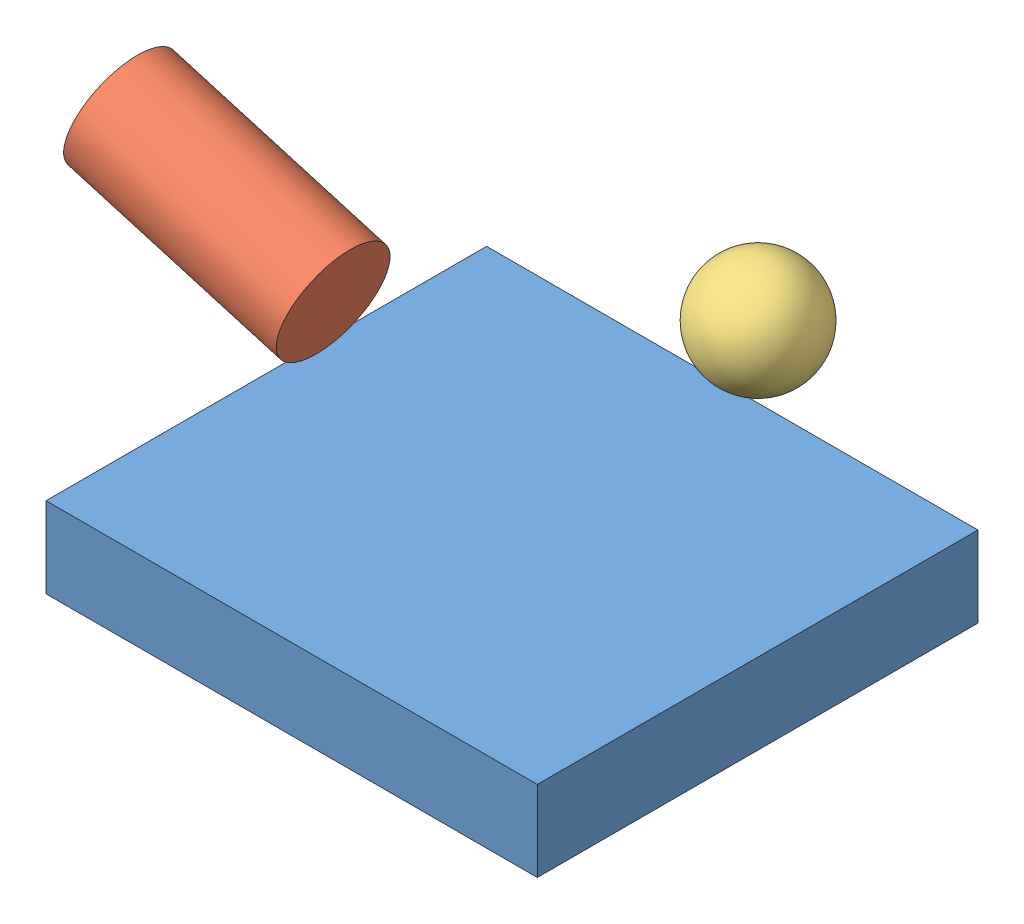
SolidWorks assembly Tangent.SLDASM, configuration Default (file format 4617). Lengths in mm.
Overall size (264.48 177.83 207.78).
3 component instances, 3 part files, 0 mates.
Components (placement in the parent):
- Simple Plate-1: Simple Plate.SLDPRT [Default] at origin size (226.59 37.18 203.2)
- Cylinder-1: Cylinder.SLDPRT [Default] at (-29.0173 148.0948 139.7994) x (0.282948 0.924675 0.254787) z (0.956826 -0.290549 -0.008117) size (50.8 50.8 101.6)
- Sphere-1: Sphere.SLDPRT [Default] at (155.3304 100.263 30.1529) x (0.086448 -0.434444 -0.896541) z (0.967204 0.252338 -0.029016) size (50.8 50.8 50.8)
